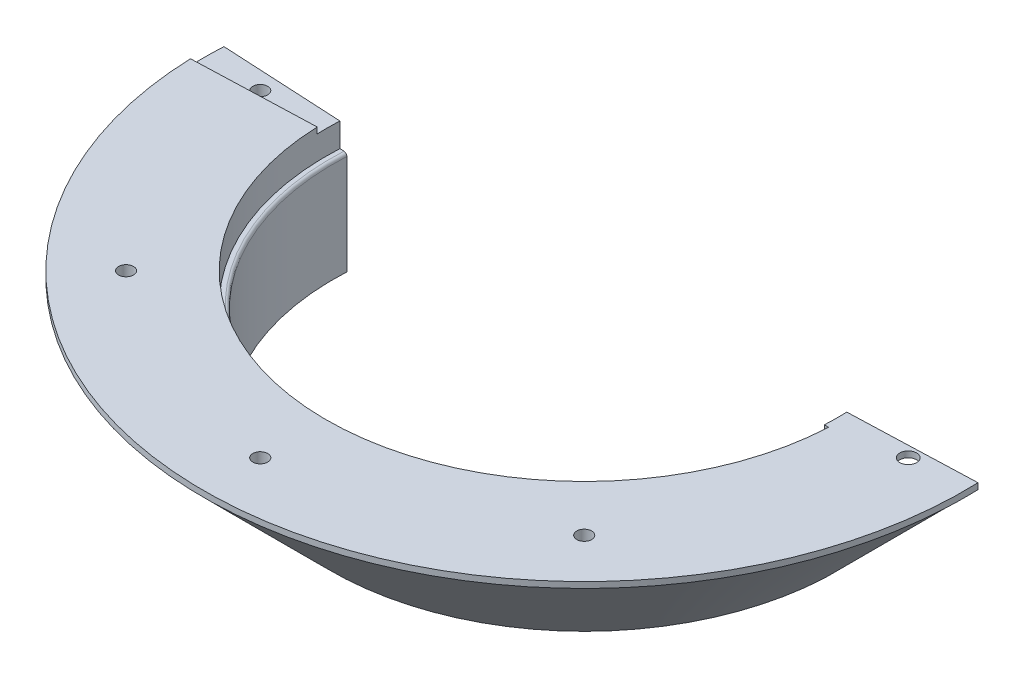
from build123d import *

# Parameters (mm, degrees)
CIRPATTERN1_COUNT               = 8
CUT_REVOLVE2_ANGLE              = 35
CUT_REVOLVE3_ANGLE              = 15
CUT_EXTRUDE1_DEPTH              = 236.864200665
CUT_EXTRUDE2_START              = -2.54
CUT_EXTRUDE2_DEPTH              = 2.54
BOSS_EXTRUDE6_DEPTH             = 2.54
F_9_32_0_28125_DIAMETER_HOLE1_D = 7.14375


with BuildPart() as part:
    # Sketch1 → Revolve1 (revolve)
    with BuildSketch(Plane.XY, mode=Mode.PRIVATE) as revolve1_sk:
        with BuildLine():
            Line((-117.883802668, 18.796), (-109.7915, 18.796))
            Line((-109.7915, 18.796), (-109.7915, 6.096))
            Line((-109.7915, 6.096), (-107.9627, 6.096))
            ThreePointArc((-107.9627, 6.096), (-107.064674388, 5.724025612), (-106.6927, 4.826))
            Line((-106.6927, 4.826), (-106.6927, -37.7063))
            Line((-106.6927, -37.7063), (-107.9627, -37.7063))
            Line((-107.9627, -37.7063), (-161.925, 16.256))
            Line((-161.925, 16.256), (-161.925, 18.796))
            Line((-161.925, 18.796), (-117.883802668, 18.796))
        make_face()
    revolve(revolve1_sk.sketch.rotate(Axis((0, 0, 0), (0, 1, 0)), 270), axis=Axis((0, 0, 0), (0, 1, 0)))

    # Sketch15 → 1_4-20 Tapped Hole1 (revolve, cut)
    with BuildSketch(Plane(origin=(137.795, 18.796, 0), x_dir=(0, 0, 1), z_dir=(1, 0, 0))):
        Polygon((0, 0), (0, 18.043816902), (2.5527, 16.51), (2.5527, 12.7), (3.175, 12.7), (3.175, 0), align=None)
    f_1_4_20_tapped_hole1 = revolve(axis=Axis((137.795, 25.146, 0), (0, -1, 0)), mode=Mode.SUBTRACT)

    # CirPattern1: 1_4-20 Tapped Hole1 ×8 about axis
    cirpattern1_axis = Axis((0, 0, 0), (0, 1, 0))
    for i in range(1, CIRPATTERN1_COUNT):
        add(f_1_4_20_tapped_hole1.rotate(cirpattern1_axis, i * 360 / CIRPATTERN1_COUNT), mode=Mode.SUBTRACT)

    # Sketch25 → Cut-Revolve2 (revolve, symmetric, cut)
    with BuildSketch(Plane(origin=(-153.469815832, 0, 63.569279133), x_dir=(-0.9238795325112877, 0, 0.38268343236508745), z_dir=(-0.38268343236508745, 0, -0.9238795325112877))) as cut_revolve2_sk:
        Polygon((-279.716031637, 18.796), (-279.716031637, 5.3848), (-276.617231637, 2.286), (-276.617231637, -29.778146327), (-325.191377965, 18.796), align=None)
    revolve(axis=Axis((0, 55.632543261, 0), (0, -1, 0)), revolution_arc=CUT_REVOLVE2_ANGLE / 2, mode=Mode.SUBTRACT)
    revolve(cut_revolve2_sk.sketch, axis=Axis((0, 55.632543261, 0), (0, 1, 0)), revolution_arc=CUT_REVOLVE2_ANGLE / 2, mode=Mode.SUBTRACT)

    # Sketch26 → Cut-Revolve3 (revolve, symmetric, cut)
    with BuildSketch(Plane(origin=(0, 0, 0), x_dir=(-0.9238795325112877, 0, 0.38268343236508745), z_dir=(-0.38268343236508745, 0, -0.9238795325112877))) as cut_revolve3_sk:
        Polygon((-110.5027, -29.778146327), (-106.6927, -33.588146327), (-106.6927, -28.199992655), (-110.5027, -24.389992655), align=None)
    revolve(axis=Axis((0, 55.632543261, 0), (0, -1, 0)), revolution_arc=CUT_REVOLVE3_ANGLE / 2, mode=Mode.SUBTRACT)
    revolve(cut_revolve3_sk.sketch, axis=Axis((0, 55.632543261, 0), (0, 1, 0)), revolution_arc=CUT_REVOLVE3_ANGLE / 2, mode=Mode.SUBTRACT)

    # Sketch21 → Cut-Extrude1 (cut, through all)
    with BuildSketch(Plane.XZ.offset(-18.796)):
        Polygon((-161.703087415, -8.474499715), (161.925, 8.48612966), (161.925, -168.577043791), (-161.703087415, -168.577043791), align=None)
    extrude(amount=CUT_EXTRUDE1_DEPTH, mode=Mode.SUBTRACT)

    # Sketch22 → Cut-Extrude2 (cut)
    with BuildSketch(Plane(origin=(0, 18.796, 0), x_dir=(1, 0, 0), z_dir=(0, 1, 0)).offset(CUT_EXTRUDE2_START)):
        with BuildLine():
            Line((-161.826359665, -5.651101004), (-107.89693204, -3.767843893))
            ThreePointArc((-107.89693204, -3.767843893), (-107.958589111, 0.942140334), (-107.814740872, 5.650331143))
            Line((-107.814740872, 5.650331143), (-161.703087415, 8.474499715))
            ThreePointArc((-161.703087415, 8.474499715), (-161.918834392, 1.413044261), (-161.826359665, -5.651101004))
        make_face()
    extrude(amount=CUT_EXTRUDE2_DEPTH, mode=Mode.SUBTRACT)

    # Sketch23 → Boss-Extrude6 (add)
    with BuildSketch(Plane(origin=(0, 18.796, 0), x_dir=(1, 0, 0), z_dir=(0, 1, 0))):
        with BuildLine():
            Line((107.89693204, 3.767843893), (161.826359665, 5.651101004))
            ThreePointArc((161.826359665, 5.651101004), (161.918834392, -1.413044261), (161.703087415, -8.474499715))
            Line((161.703087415, -8.474499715), (107.814740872, -5.650331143))
            ThreePointArc((107.814740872, -5.650331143), (107.958589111, -0.942140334), (107.89693204, 3.767843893))
        make_face()
    extrude(amount=-BOSS_EXTRUDE6_DEPTH)

    # 9_32 _0.28125_ Diameter Hole1 (through all)
    with Locations(Plane(origin=(0, 18.796, 0), x_dir=(1, 0, 0), z_dir=(0, 1, 0))):
        with Locations((137.795, 0)):
            Hole(F_9_32_0_28125_DIAMETER_HOLE1_D / 2)


solid = part.part
